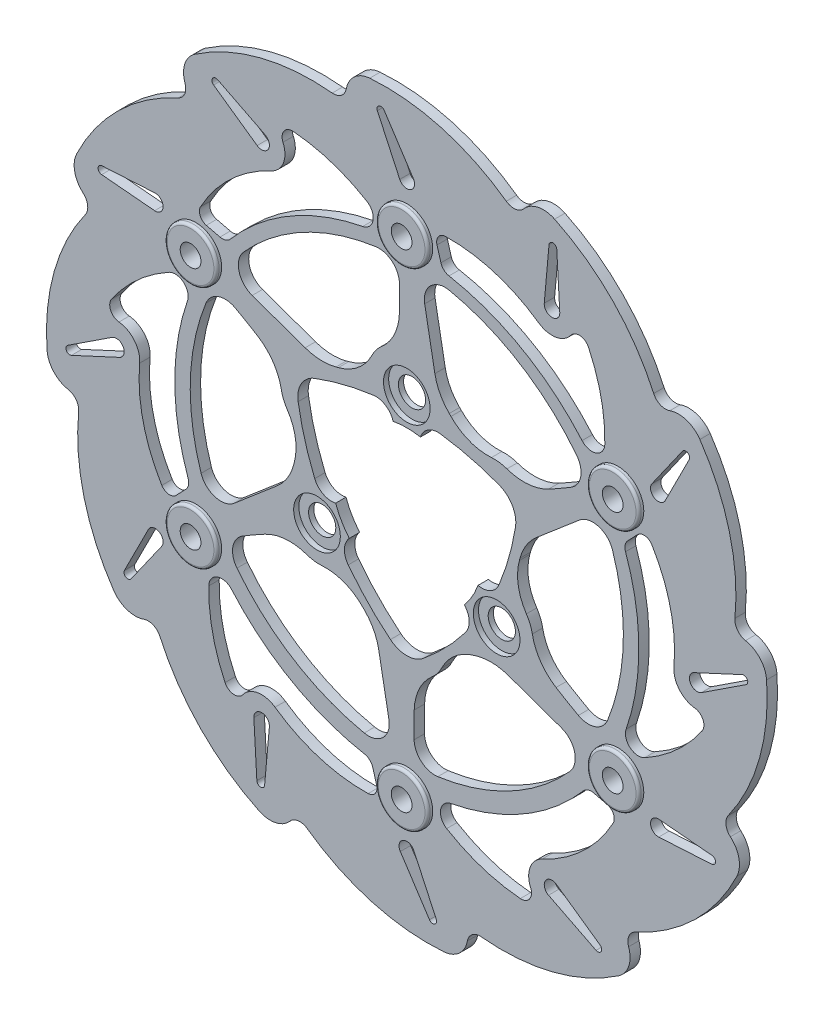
from build123d import *

# Parameters (mm, degrees)
ESQUISSE1_R         = 139.5
ESQUISSE1_R_2       = 5.25
ESQUISSE1_R_3       = 29.15
EXTRUSION1_DEPTH    = 4
ESQUISSE2_R         = 4
EXTRUSION2_DEPTH    = 10
EXTRUSION3_START    = 2
ESQUISSE3_R         = 10
ESQUISSE3_R_2       = 4
EXTRUSION3_DEPTH    = 2
CONG_1_R            = 1
EXTRUSION4_DEPTH    = 10
EXTRUSION5_START    = -10
EXTRUSION5_DEPTH    = 10
ESQUISSE6_R         = 9
EXTRUSION6_DEPTH    = 2
EXTRUSION7_DEPTH    = 10
ESQUISSE9_OUTSIDE_W = 359.922
ESQUISSE9_OUTSIDE_H = 359.922
EXTRUSION8_DEPTH    = 10
EXTRUSION9_DEPTH    = 10


with BuildPart() as part:
    # Esquisse1 → Extrusion1 (new body)
    with BuildSketch(Plane.XY):
        Circle(ESQUISSE1_R)
        with Locations((0, 40)):
            Circle(ESQUISSE1_R_2, mode=Mode.SUBTRACT)
        with Locations((-34.641016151, -20)):
            Circle(ESQUISSE1_R_2, mode=Mode.SUBTRACT)
        with Locations((34.641016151, -20)):
            Circle(ESQUISSE1_R_2, mode=Mode.SUBTRACT)
        Circle(ESQUISSE1_R_3, mode=Mode.SUBTRACT)
    extrude(amount=EXTRUSION1_DEPTH)

    # Esquisse2 → Extrusion2 (cut)
    with BuildSketch(Plane.XY.offset(4)):
        with Locations((0, 94)):
            Circle(ESQUISSE2_R)
        with Locations((81.406387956, 47)):
            Circle(ESQUISSE2_R)
        with Locations((81.406387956, -47)):
            Circle(ESQUISSE2_R)
        with Locations((0, -94)):
            Circle(ESQUISSE2_R)
        with Locations((-81.406387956, -47)):
            Circle(ESQUISSE2_R)
        with Locations((-81.406387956, 47)):
            Circle(ESQUISSE2_R)
    extrude(amount=-EXTRUSION2_DEPTH, mode=Mode.SUBTRACT)

    # Esquisse3 → Extrusion3 (add)
    # profile 1 of 6: a face of its own
    with BuildSketch(Plane.XY.offset(4).offset(EXTRUSION3_START)):
        with Locations((0, 94)):
            Circle(ESQUISSE3_R)
        with Locations((0, 94)):
            Circle(ESQUISSE3_R_2, mode=Mode.SUBTRACT)
    # profile 2 of 6: a face of its own
    with BuildSketch(Plane.XY.offset(4).offset(EXTRUSION3_START)):
        with Locations((81.406387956, 47)):
            Circle(ESQUISSE3_R)
        with Locations((81.406387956, 47)):
            Circle(ESQUISSE3_R_2, mode=Mode.SUBTRACT)
    # profile 3 of 6: a face of its own
    with BuildSketch(Plane.XY.offset(4).offset(EXTRUSION3_START)):
        with Locations((81.406387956, -47)):
            Circle(ESQUISSE3_R)
        with Locations((81.406387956, -47)):
            Circle(ESQUISSE3_R_2, mode=Mode.SUBTRACT)
    # profile 4 of 6: a face of its own
    with BuildSketch(Plane.XY.offset(4).offset(EXTRUSION3_START)):
        with Locations((0, -94)):
            Circle(ESQUISSE3_R)
        with Locations((0, -94)):
            Circle(ESQUISSE3_R_2, mode=Mode.SUBTRACT)
    # profile 5 of 6: a face of its own
    with BuildSketch(Plane.XY.offset(4).offset(EXTRUSION3_START)):
        with Locations((-81.406387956, -47)):
            Circle(ESQUISSE3_R)
        with Locations((-81.406387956, -47)):
            Circle(ESQUISSE3_R_2, mode=Mode.SUBTRACT)
    # profile 6 of 6: a face of its own
    with BuildSketch(Plane.XY.offset(4).offset(EXTRUSION3_START)):
        with Locations((-81.406387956, 47)):
            Circle(ESQUISSE3_R)
        with Locations((-81.406387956, 47)):
            Circle(ESQUISSE3_R_2, mode=Mode.SUBTRACT)
    extrude(amount=-EXTRUSION3_DEPTH)

    # Cong_1
    cong_1_edges = [part.edges().sort_by_distance(p)[0] for p in [
        (-10, 94, 6),
        (71.406387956, 47, 6),
        (71.406387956, -47, 6),
        (-10, -94, 6),
        (-91.406387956, -47, 6),
        (-91.406387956, 47, 6),
    ]]
    fillet(cong_1_edges, radius=CONG_1_R)

    # Esquisse4 → Extrusion4 (cut)
    with BuildSketch(Plane.XY.offset(4)):
        with BuildLine():
            Line((-8.745313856, 130.822047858), (2.509372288, 113.644095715))
            ThreePointArc((2.509372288, 113.644095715), (1.456928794, 109.377528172), (-2.721636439, 110.737979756))
            Line((-2.721636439, 110.737979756), (-11.360818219, 129.368989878))
            ThreePointArc((-11.360818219, 129.368989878), (-10.728464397, 131.311235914), (-8.745313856, 130.822047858))
        make_face()
        with BuildLine():
            Line((57.837359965, 117.667873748), (58.995228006, 97.163987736))
            ThreePointArc((58.995228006, 97.163987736), (55.950501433, 93.995253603), (53.011983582, 97.262721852))
            Line((53.011983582, 97.262721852), (54.845737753, 117.717240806))
            ThreePointArc((54.845737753, 117.717240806), (56.364495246, 119.083098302), (57.837359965, 117.667873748))
        make_face()
        with BuildLine():
            Line((108.922559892, 72.984687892), (99.673360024, 54.648867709))
            ThreePointArc((99.673360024, 54.648867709), (95.452182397, 53.427026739), (94.541085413, 57.725996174))
            Line((94.541085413, 57.725996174), (106.356422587, 74.523252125))
            ThreePointArc((106.356422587, 74.523252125), (108.354633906, 74.946740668), (108.922559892, 72.984687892))
        make_face()
        with BuildLine():
            Line((130.822047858, 8.745313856), (113.644095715, -2.509372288))
            ThreePointArc((113.644095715, -2.509372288), (109.377528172, -1.456928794), (110.737979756, 2.721636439))
            Line((110.737979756, 2.721636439), (129.368989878, 11.360818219))
            ThreePointArc((129.368989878, 11.360818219), (131.311235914, 10.728464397), (130.822047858, 8.745313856))
        make_face()
        with BuildLine():
            Line((117.667873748, -57.837359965), (97.163987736, -58.995228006))
            ThreePointArc((97.163987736, -58.995228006), (93.995253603, -55.950501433), (97.262721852, -53.011983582))
            Line((97.262721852, -53.011983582), (117.717240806, -54.845737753))
            ThreePointArc((117.717240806, -54.845737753), (119.083098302, -56.364495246), (117.667873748, -57.837359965))
        make_face()
        with BuildLine():
            Line((72.984687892, -108.922559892), (54.648867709, -99.673360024))
            ThreePointArc((54.648867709, -99.673360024), (53.427026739, -95.452182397), (57.725996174, -94.541085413))
            Line((57.725996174, -94.541085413), (74.523252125, -106.356422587))
            ThreePointArc((74.523252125, -106.356422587), (74.946740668, -108.354633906), (72.984687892, -108.922559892))
        make_face()
        with BuildLine():
            Line((8.745313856, -130.822047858), (-2.509372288, -113.644095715))
            ThreePointArc((-2.509372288, -113.644095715), (-1.456928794, -109.377528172), (2.721636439, -110.737979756))
            Line((2.721636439, -110.737979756), (11.360818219, -129.368989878))
            ThreePointArc((11.360818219, -129.368989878), (10.728464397, -131.311235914), (8.745313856, -130.822047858))
        make_face()
        with BuildLine():
            Line((-57.837359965, -117.667873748), (-58.995228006, -97.163987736))
            ThreePointArc((-58.995228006, -97.163987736), (-55.950501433, -93.995253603), (-53.011983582, -97.262721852))
            Line((-53.011983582, -97.262721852), (-54.845737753, -117.717240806))
            ThreePointArc((-54.845737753, -117.717240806), (-56.364495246, -119.083098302), (-57.837359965, -117.667873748))
        make_face()
        with BuildLine():
            Line((-108.922559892, -72.984687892), (-99.673360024, -54.648867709))
            ThreePointArc((-99.673360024, -54.648867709), (-95.452182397, -53.427026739), (-94.541085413, -57.725996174))
            Line((-94.541085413, -57.725996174), (-106.356422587, -74.523252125))
            ThreePointArc((-106.356422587, -74.523252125), (-108.354633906, -74.946740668), (-108.922559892, -72.984687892))
        make_face()
        with BuildLine():
            Line((-130.822047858, -8.745313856), (-113.644095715, 2.509372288))
            ThreePointArc((-113.644095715, 2.509372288), (-109.377528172, 1.456928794), (-110.737979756, -2.721636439))
            Line((-110.737979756, -2.721636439), (-129.368989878, -11.360818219))
            ThreePointArc((-129.368989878, -11.360818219), (-131.311235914, -10.728464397), (-130.822047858, -8.745313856))
        make_face()
        with BuildLine():
            Line((-117.667873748, 57.837359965), (-97.163987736, 58.995228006))
            ThreePointArc((-97.163987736, 58.995228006), (-93.995253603, 55.950501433), (-97.262721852, 53.011983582))
            Line((-97.262721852, 53.011983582), (-117.717240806, 54.845737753))
            ThreePointArc((-117.717240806, 54.845737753), (-119.083098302, 56.364495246), (-117.667873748, 57.837359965))
        make_face()
        with BuildLine():
            Line((-72.984687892, 108.922559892), (-54.648867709, 99.673360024))
            ThreePointArc((-54.648867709, 99.673360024), (-53.427026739, 95.452182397), (-57.725996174, 94.541085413))
            Line((-57.725996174, 94.541085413), (-74.523252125, 106.356422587))
            ThreePointArc((-74.523252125, 106.356422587), (-74.946740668, 108.354633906), (-72.984687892, 108.922559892))
        make_face()
    extrude(amount=-EXTRUSION4_DEPTH, mode=Mode.SUBTRACT)

    # Esquisse5 → Extrusion5 (cut)
    with BuildSketch(Plane.XY.offset(4).offset(EXTRUSION5_START)):
        with BuildLine():
            ThreePointArc((41.915881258, 16.910965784), (40.703193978, 23.5), (35.6032666, 27.844735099))
            ThreePointArc((35.6032666, 27.844735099), (24.424767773, 31.368672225), (12.910728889, 33.560447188))
            ThreePointArc((12.910728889, 33.560447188), (8.198336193, 32.507401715), (5.267266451, 28.67016575))
            ThreePointArc((5.267266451, 28.67016575), (0, 29.15), (-5.267266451, 28.67016575))
            ThreePointArc((-5.267266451, 28.67016575), (-8.198336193, 32.507401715), (-12.910728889, 33.560447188))
            ThreePointArc((-12.910728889, 33.560447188), (-24.424767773, 31.368672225), (-35.6032666, 27.844735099))
            ThreePointArc((-35.6032666, 27.844735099), (-40.703193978, 23.5), (-41.915881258, 16.910965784))
            ThreePointArc((-41.915881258, 16.910965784), (-39.378450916, 5.46813326), (-35.519564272, -5.599204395))
            ThreePointArc((-35.519564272, -5.599204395), (-32.251403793, -9.153733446), (-27.462725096, -9.77349632))
            ThreePointArc((-27.462725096, -9.77349632), (-25.24464052, -14.575), (-22.195458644, -18.89666943))
            ThreePointArc((-22.195458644, -18.89666943), (-24.0530676, -23.35366827), (-22.608835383, -27.961242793))
            ThreePointArc((-22.608835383, -27.961242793), (-14.953683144, -36.836805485), (-6.312614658, -44.755700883))
            ThreePointArc((-6.312614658, -44.755700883), (0, -47), (6.312614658, -44.755700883))
            ThreePointArc((6.312614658, -44.755700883), (14.953683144, -36.836805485), (22.608835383, -27.961242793))
            ThreePointArc((22.608835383, -27.961242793), (24.0530676, -23.35366827), (22.195458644, -18.89666943))
            ThreePointArc((22.195458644, -18.89666943), (25.24464052, -14.575), (27.462725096, -9.77349632))
            ThreePointArc((27.462725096, -9.77349632), (32.251403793, -9.153733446), (35.519564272, -5.599204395))
            ThreePointArc((35.519564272, -5.599204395), (39.378450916, 5.46813326), (41.915881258, 16.910965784))
        make_face()
    extrude(amount=EXTRUSION5_DEPTH, mode=Mode.SUBTRACT)

    # Esquisse6 → Extrusion6 (cut)
    with BuildSketch(Plane.XY.offset(4)):
        with Locations((0, 40)):
            Circle(ESQUISSE6_R)
        with Locations((34.641016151, -20)):
            Circle(ESQUISSE6_R)
        with Locations((-34.641016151, -20)):
            Circle(ESQUISSE6_R)
    extrude(amount=-EXTRUSION6_DEPTH, mode=Mode.SUBTRACT)

    # Esquisse8 → Extrusion7 (cut)
    with BuildSketch(Plane.XY.offset(4)):
        with BuildLine():
            Line((11.64065866, 96.017744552), (13.160752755, 90.81897987))
            ThreePointArc((13.160752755, 90.81897987), (14.318888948, 88.973116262), (16.272727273, 88.00822886))
            ThreePointArc((16.272727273, 88.00822886), (44.425451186, 77.695748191), (67.59267961, 58.664125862))
            ThreePointArc((67.59267961, 58.664125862), (73.070549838, 57.239954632), (76.36778456, 61.840342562))
            ThreePointArc((76.36778456, 61.840342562), (74.932894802, 76.799033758), (70.101234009, 91.028454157))
            ThreePointArc((70.101234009, 91.028454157), (66.865084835, 93.295306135), (63.260705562, 91.676748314))
            ThreePointArc((63.260705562, 91.676748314), (57.463489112, 88.114631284), (50.829800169, 89.628093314))
            ThreePointArc((50.829800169, 89.628093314), (33.74439349, 97.943284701), (14.915640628, 100.498983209))
            ThreePointArc((14.915640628, 100.498983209), (12.174200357, 99.06515287), (11.64065866, 96.017744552))
        make_face()
        with BuildLine():
            Line((88.974135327, 37.927766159), (85.23192009, 34.011943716))
            ThreePointArc((85.23192009, 34.011943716), (84.212423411, 32.086036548), (84.353725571, 29.911519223))
            ThreePointArc((84.353725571, 29.911519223), (89.499217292, 0.374304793), (84.600963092, -29.204914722))
            ThreePointArc((84.600963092, -29.204914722), (86.106529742, -34.660975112), (91.739199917, -35.216270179))
            ThreePointArc((91.739199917, -35.216270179), (103.976361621, -26.494273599), (113.883570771, -15.19522241))
            ThreePointArc((113.883570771, -15.19522241), (114.228647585, -11.259209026), (111.024745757, -8.947003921))
            ThreePointArc((111.024745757, -8.947003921), (105.041253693, -5.707525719), (103.035105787, 0.794148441))
            ThreePointArc((103.035105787, 0.794148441), (101.693569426, 19.748140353), (94.492492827, 37.332167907))
            ThreePointArc((94.492492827, 37.332167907), (91.880039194, 38.989409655), (88.974135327, 37.927766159))
        make_face()
        with BuildLine():
            Line((77.333476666, -58.089978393), (72.071167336, -56.807036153))
            ThreePointArc((72.071167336, -56.807036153), (69.893534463, -56.887079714), (68.080998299, -58.096709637))
            ThreePointArc((68.080998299, -58.096709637), (45.073766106, -77.321443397), (17.008283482, -87.869040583))
            ThreePointArc((17.008283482, -87.869040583), (13.035979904, -91.900929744), (15.371415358, -97.056612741))
            ThreePointArc((15.371415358, -97.056612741), (29.043466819, -103.293307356), (43.782336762, -106.223676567))
            ThreePointArc((43.782336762, -106.223676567), (47.363562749, -104.554515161), (47.764040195, -100.623752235))
            ThreePointArc((47.764040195, -100.623752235), (47.577764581, -93.822157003), (52.205305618, -88.833944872))
            ThreePointArc((52.205305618, -88.833944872), (67.949175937, -78.195144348), (79.5768522, -63.166815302))
            ThreePointArc((79.5768522, -63.166815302), (79.705838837, -60.075743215), (77.333476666, -58.089978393))
        make_face()
        with BuildLine():
            Line((-11.64065866, -96.017744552), (-13.160752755, -90.81897987))
            ThreePointArc((-13.160752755, -90.81897987), (-14.318888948, -88.973116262), (-16.272727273, -88.00822886))
            ThreePointArc((-16.272727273, -88.00822886), (-44.425451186, -77.695748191), (-67.59267961, -58.664125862))
            ThreePointArc((-67.59267961, -58.664125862), (-73.070549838, -57.239954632), (-76.36778456, -61.840342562))
            ThreePointArc((-76.36778456, -61.840342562), (-74.932894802, -76.799033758), (-70.101234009, -91.028454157))
            ThreePointArc((-70.101234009, -91.028454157), (-66.865084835, -93.295306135), (-63.260705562, -91.676748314))
            ThreePointArc((-63.260705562, -91.676748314), (-57.463489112, -88.114631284), (-50.829800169, -89.628093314))
            ThreePointArc((-50.829800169, -89.628093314), (-33.74439349, -97.943284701), (-14.915640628, -100.498983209))
            ThreePointArc((-14.915640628, -100.498983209), (-12.174200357, -99.06515287), (-11.64065866, -96.017744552))
        make_face()
        with BuildLine():
            Line((-88.974135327, -37.927766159), (-85.23192009, -34.011943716))
            ThreePointArc((-85.23192009, -34.011943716), (-84.212423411, -32.086036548), (-84.353725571, -29.911519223))
            ThreePointArc((-84.353725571, -29.911519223), (-89.499217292, -0.374304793), (-84.600963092, 29.204914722))
            ThreePointArc((-84.600963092, 29.204914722), (-86.106529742, 34.660975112), (-91.739199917, 35.216270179))
            ThreePointArc((-91.739199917, 35.216270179), (-103.976361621, 26.494273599), (-113.883570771, 15.19522241))
            ThreePointArc((-113.883570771, 15.19522241), (-114.228647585, 11.259209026), (-111.024745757, 8.947003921))
            ThreePointArc((-111.024745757, 8.947003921), (-105.041253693, 5.707525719), (-103.035105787, -0.794148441))
            ThreePointArc((-103.035105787, -0.794148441), (-101.693569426, -19.748140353), (-94.492492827, -37.332167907))
            ThreePointArc((-94.492492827, -37.332167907), (-91.880039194, -38.989409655), (-88.974135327, -37.927766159))
        make_face()
        with BuildLine():
            Line((-77.333476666, 58.089978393), (-72.071167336, 56.807036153))
            ThreePointArc((-72.071167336, 56.807036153), (-69.893534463, 56.887079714), (-68.080998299, 58.096709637))
            ThreePointArc((-68.080998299, 58.096709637), (-45.073766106, 77.321443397), (-17.008283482, 87.869040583))
            ThreePointArc((-17.008283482, 87.869040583), (-13.035979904, 91.900929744), (-15.371415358, 97.056612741))
            ThreePointArc((-15.371415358, 97.056612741), (-29.043466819, 103.293307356), (-43.782336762, 106.223676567))
            ThreePointArc((-43.782336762, 106.223676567), (-47.363562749, 104.554515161), (-47.764040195, 100.623752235))
            ThreePointArc((-47.764040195, 100.623752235), (-47.577764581, 93.822157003), (-52.205305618, 88.833944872))
            ThreePointArc((-52.205305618, 88.833944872), (-67.949175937, 78.195144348), (-79.5768522, 63.166815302))
            ThreePointArc((-79.5768522, 63.166815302), (-79.705838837, 60.075743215), (-77.333476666, 58.089978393))
        make_face()
    extrude(amount=-EXTRUSION7_DEPTH, mode=Mode.SUBTRACT)

    # Esquisse9 outside → Extrusion8 (cut)
    with BuildSketch(Plane.XY.offset(4)):
        Rectangle(ESQUISSE9_OUTSIDE_W, ESQUISSE9_OUTSIDE_H)
        with BuildLine():
            ThreePointArc((-81.753874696, 113.028427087), (-85.621919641, 107.877111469), (-85.545817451, 101.435680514))
            ThreePointArc((-85.545817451, 101.435680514), (-85.660742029, 97.808069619), (-88.199065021, 95.213906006))
            ThreePointArc((-88.199065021, 95.213906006), (-111.122480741, 79.556826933), (-127.315145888, 57.008551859))
            ThreePointArc((-127.315145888, 57.008551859), (-128.089313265, 50.613359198), (-124.802691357, 45.07296745))
            ThreePointArc((-124.802691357, 45.07296745), (-123.088413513, 41.873901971), (-123.989583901, 38.358128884))
            ThreePointArc((-123.989583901, 38.358128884), (-136.01330472, 13.336992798), (-138.762426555, -14.286718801))
            ThreePointArc((-138.762426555, -14.286718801), (-136.23527884, -20.212201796), (-130.6187849, -23.367010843))
            ThreePointArc((-130.6187849, -23.367010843), (-127.534643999, -25.280343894), (-126.557193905, -28.775677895))
            ThreePointArc((-126.557193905, -28.775677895), (-124.459473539, -56.456477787), (-113.028427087, -81.753874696))
            ThreePointArc((-113.028427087, -81.753874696), (-107.877111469, -85.621919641), (-101.435680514, -85.545817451))
            ThreePointArc((-101.435680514, -85.545817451), (-97.808069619, -85.660742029), (-95.213906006, -88.199065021))
            ThreePointArc((-95.213906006, -88.199065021), (-79.556826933, -111.122480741), (-57.008551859, -127.315145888))
            ThreePointArc((-57.008551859, -127.315145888), (-50.613359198, -128.089313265), (-45.07296745, -124.802691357))
            ThreePointArc((-45.07296745, -124.802691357), (-41.873901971, -123.088413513), (-38.358128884, -123.989583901))
            ThreePointArc((-38.358128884, -123.989583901), (-13.336992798, -136.01330472), (14.286718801, -138.762426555))
            ThreePointArc((14.286718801, -138.762426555), (20.212201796, -136.23527884), (23.367010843, -130.6187849))
            ThreePointArc((23.367010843, -130.6187849), (25.280343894, -127.534643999), (28.775677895, -126.557193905))
            ThreePointArc((28.775677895, -126.557193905), (56.456477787, -124.459473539), (81.753874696, -113.028427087))
            ThreePointArc((81.753874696, -113.028427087), (85.621919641, -107.877111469), (85.545817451, -101.435680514))
            ThreePointArc((85.545817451, -101.435680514), (85.660742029, -97.808069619), (88.199065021, -95.213906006))
            ThreePointArc((88.199065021, -95.213906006), (111.122480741, -79.556826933), (127.315145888, -57.008551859))
            ThreePointArc((127.315145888, -57.008551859), (128.089313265, -50.613359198), (124.802691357, -45.07296745))
            ThreePointArc((124.802691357, -45.07296745), (123.088413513, -41.873901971), (123.989583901, -38.358128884))
            ThreePointArc((123.989583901, -38.358128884), (136.01330472, -13.336992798), (138.762426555, 14.286718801))
            ThreePointArc((138.762426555, 14.286718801), (136.23527884, 20.212201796), (130.6187849, 23.367010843))
            ThreePointArc((130.6187849, 23.367010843), (127.534643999, 25.280343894), (126.557193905, 28.775677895))
            ThreePointArc((126.557193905, 28.775677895), (124.459473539, 56.456477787), (113.028427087, 81.753874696))
            ThreePointArc((113.028427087, 81.753874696), (107.877111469, 85.621919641), (101.435680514, 85.545817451))
            ThreePointArc((101.435680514, 85.545817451), (97.808069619, 85.660742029), (95.213906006, 88.199065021))
            ThreePointArc((95.213906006, 88.199065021), (79.556826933, 111.122480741), (57.008551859, 127.315145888))
            ThreePointArc((57.008551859, 127.315145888), (50.613359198, 128.089313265), (45.07296745, 124.802691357))
            ThreePointArc((45.07296745, 124.802691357), (41.873901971, 123.088413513), (38.358128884, 123.989583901))
            ThreePointArc((38.358128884, 123.989583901), (13.336992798, 136.01330472), (-14.286718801, 138.762426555))
            ThreePointArc((-14.286718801, 138.762426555), (-20.212201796, 136.23527884), (-23.367010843, 130.6187849))
            ThreePointArc((-23.367010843, 130.6187849), (-25.280343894, 127.534643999), (-28.775677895, 126.557193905))
            ThreePointArc((-28.775677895, 126.557193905), (-56.456477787, 124.459473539), (-81.753874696, 113.028427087))
        make_face(mode=Mode.SUBTRACT)
    extrude(amount=-EXTRUSION8_DEPTH, mode=Mode.SUBTRACT)

    # Esquisse10 → Extrusion9 (cut)
    with BuildSketch(Plane.XY.offset(4)):
        with BuildLine():
            Line((-59.652225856, 43.513829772), (-39.21161634, 36.249387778))
            ThreePointArc((-39.21161634, 36.249387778), (-33.297262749, 35.109988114), (-27.311885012, 35.783087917))
            ThreePointArc((-27.311885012, 35.783087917), (-26.861129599, 35.903441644), (-26.40984387, 36.021791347))
            ThreePointArc((-26.40984387, 36.021791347), (-18.785868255, 39.891226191), (-13.474410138, 46.590923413))
            ThreePointArc((-13.474410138, 46.590923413), (-11.877026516, 49.161672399), (-9.796095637, 51.359423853))
            ThreePointArc((-9.796095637, 51.359423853), (-4.797723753, 57.912159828), (-2.866004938, 65.92405927))
            ThreePointArc((-2.866004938, 65.92405927), (-2.78322798, 70.910236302), (-2.824794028, 75.896927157))
            ThreePointArc((-2.824794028, 75.896927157), (-5.644767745, 81.828489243), (-11.954886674, 83.650048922))
            ThreePointArc((-11.954886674, 83.650048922), (-39.846586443, 74.515096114), (-62.931224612, 56.390699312))
            ThreePointArc((-62.931224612, 56.390699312), (-64.725836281, 49.077793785), (-59.652225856, 43.513829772))
        make_face()
        with BuildLine():
            Line((6.891931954, 73.966968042), (10.821045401, 52.632659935))
            ThreePointArc((10.821045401, 52.632659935), (12.791473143, 46.940979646), (16.36708354, 42.094040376))
            ThreePointArc((16.36708354, 42.094040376), (16.696690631, 41.763851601), (17.024827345, 41.432201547))
            ThreePointArc((17.024827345, 41.432201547), (24.187844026, 36.764362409), (32.645681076, 35.514353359))
            ThreePointArc((32.645681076, 35.514353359), (35.670706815, 35.416353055), (38.614480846, 34.713089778))
            ThreePointArc((38.614480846, 34.713089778), (46.788502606, 33.660740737), (54.692870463, 35.993772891))
            ThreePointArc((54.692870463, 35.993772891), (59.052414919, 38.415174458), (63.350232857, 40.944517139))
            ThreePointArc((63.350232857, 40.944517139), (67.077129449, 46.352467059), (65.499586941, 52.727970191))
            ThreePointArc((65.499586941, 52.727970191), (43.642635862, 72.315414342), (16.404128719, 83.245099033))
            ThreePointArc((16.404128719, 83.245099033), (9.173660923, 81.142825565), (6.891931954, 73.966968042))
        make_face()
        with BuildLine():
            Line((66.537202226, 31.56460604), (50.025706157, 17.494739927))
            ThreePointArc((50.025706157, 17.494739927), (46.081780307, 12.942459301), (43.672012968, 7.422420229))
            ThreePointArc((43.672012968, 7.422420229), (43.550864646, 6.971877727), (43.42771563, 6.52187797))
            ThreePointArc((43.42771563, 6.52187797), (42.966756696, -2.015396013), (46.11313563, -9.965102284))
            ThreePointArc((46.11313563, -9.965102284), (47.540777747, -12.633851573), (48.403620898, -15.534866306))
            ThreePointArc((48.403620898, -15.534866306), (51.579270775, -23.139951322), (57.551919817, -28.818818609))
            ThreePointArc((57.551919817, -28.818818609), (61.828687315, -31.383594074), (66.1680713, -33.840942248))
            ThreePointArc((66.1680713, -33.840942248), (72.71494161, -34.364554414), (77.44751803, -29.810610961))
            ThreePointArc((77.44751803, -29.810610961), (83.482266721, -1.088214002), (79.328397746, 27.965867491))
            ThreePointArc((79.328397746, 27.965867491), (73.892541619, 33.17649955), (66.537202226, 31.56460604))
        make_face()
        with BuildLine():
            Line((59.638314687, -41.290894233), (39.197705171, -34.026452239))
            ThreePointArc((39.197705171, -34.026452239), (33.28335158, -32.887052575), (27.297973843, -33.560152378))
            ThreePointArc((27.297973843, -33.560152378), (26.84721843, -33.680506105), (26.395932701, -33.798855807))
            ThreePointArc((26.395932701, -33.798855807), (18.771957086, -37.668290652), (13.460498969, -44.367987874))
            ThreePointArc((13.460498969, -44.367987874), (11.863115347, -46.938736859), (9.782184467, -49.136488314))
            ThreePointArc((9.782184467, -49.136488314), (4.783812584, -55.689224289), (2.852093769, -63.70112373))
            ThreePointArc((2.852093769, -63.70112373), (2.769316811, -68.687300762), (2.810882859, -73.673991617))
            ThreePointArc((2.810882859, -73.673991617), (5.630856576, -79.605553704), (11.940975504, -81.427113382))
            ThreePointArc((11.940975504, -81.427113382), (39.832675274, -72.292160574), (62.917313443, -54.167763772))
            ThreePointArc((62.917313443, -54.167763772), (64.711925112, -46.854858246), (59.638314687, -41.290894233))
        make_face()
        with BuildLine():
            Line((-6.905843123, -71.744032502), (-10.83495657, -50.409724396))
            ThreePointArc((-10.83495657, -50.409724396), (-12.805384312, -44.718044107), (-16.380994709, -39.871104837))
            ThreePointArc((-16.380994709, -39.871104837), (-16.7106018, -39.540916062), (-17.038738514, -39.209266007))
            ThreePointArc((-17.038738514, -39.209266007), (-24.201755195, -34.541426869), (-32.659592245, -33.291417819))
            ThreePointArc((-32.659592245, -33.291417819), (-35.684617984, -33.193417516), (-38.628392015, -32.490154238))
            ThreePointArc((-38.628392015, -32.490154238), (-46.802413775, -31.437805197), (-54.706781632, -33.770837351))
            ThreePointArc((-54.706781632, -33.770837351), (-59.066326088, -36.192238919), (-63.364144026, -38.721581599))
            ThreePointArc((-63.364144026, -38.721581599), (-67.091040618, -44.12953152), (-65.51349811, -50.505034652))
            ThreePointArc((-65.51349811, -50.505034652), (-43.656547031, -70.092478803), (-16.418039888, -81.022163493))
            ThreePointArc((-16.418039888, -81.022163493), (-9.187572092, -78.919890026), (-6.905843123, -71.744032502))
        make_face()
        with BuildLine():
            Line((-66.551113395, -29.3416705), (-50.039617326, -15.271804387))
            ThreePointArc((-50.039617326, -15.271804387), (-46.095691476, -10.719523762), (-43.685924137, -5.199484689))
            ThreePointArc((-43.685924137, -5.199484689), (-43.564775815, -4.748942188), (-43.441626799, -4.298942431))
            ThreePointArc((-43.441626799, -4.298942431), (-42.980667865, 4.238331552), (-46.127046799, 12.188037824))
            ThreePointArc((-46.127046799, 12.188037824), (-47.554688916, 14.856787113), (-48.417532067, 17.757801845))
            ThreePointArc((-48.417532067, 17.757801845), (-51.593181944, 25.362886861), (-57.565830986, 31.041754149))
            ThreePointArc((-57.565830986, 31.041754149), (-61.842598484, 33.606529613), (-66.181982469, 36.063877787))
            ThreePointArc((-66.181982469, 36.063877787), (-72.728852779, 36.587489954), (-77.461429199, 32.0335465))
            ThreePointArc((-77.461429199, 32.0335465), (-83.49617789, 3.311149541), (-79.342308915, -25.742931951))
            ThreePointArc((-79.342308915, -25.742931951), (-73.906452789, -30.953564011), (-66.551113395, -29.3416705))
        make_face()
    extrude(amount=-EXTRUSION9_DEPTH, mode=Mode.SUBTRACT)


solid = part.part
